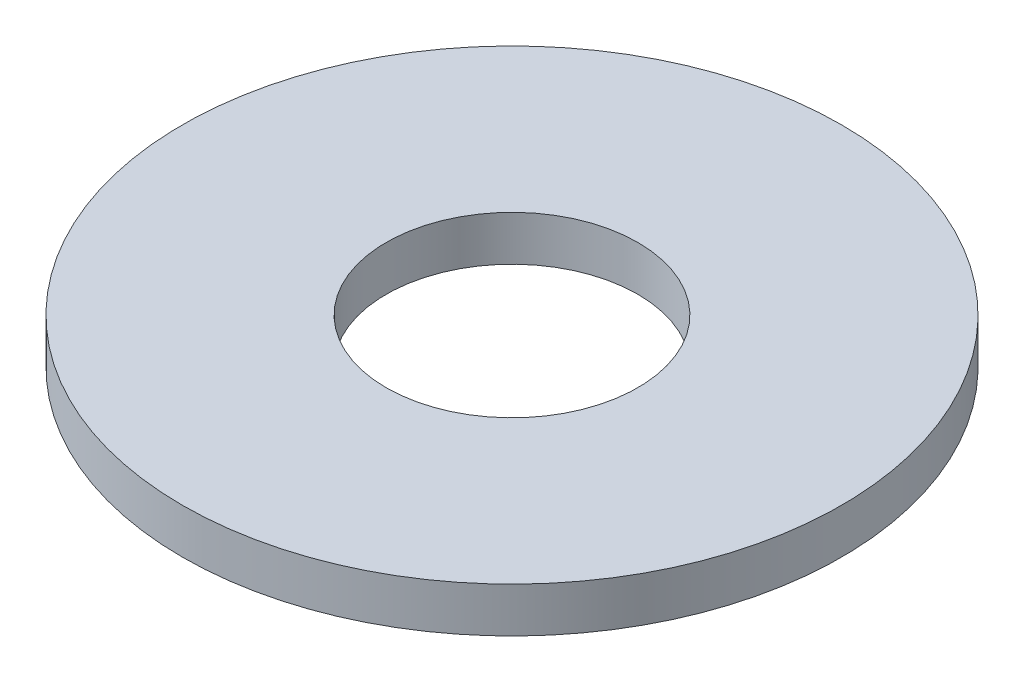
ISO-10303-21;
HEADER;
FILE_DESCRIPTION(('STEP AP214'),'2;1');
FILE_NAME('part.step','',(''),(''),'','','');
FILE_SCHEMA(('AUTOMOTIVE_DESIGN { 1 0 10303 214 1 1 1 1 }'));
ENDSEC;
DATA;
#1=APPLICATION_CONTEXT('core data for automotive mechanical design processes');
#2=APPLICATION_PROTOCOL_DEFINITION('international standard','automotive_design',2000,#1);
#3=PRODUCT_CONTEXT('',#1,'mechanical');
#4=PRODUCT('Part','Part','',(#3));
#5=PRODUCT_RELATED_PRODUCT_CATEGORY('part','',(#4));
#6=PRODUCT_DEFINITION_FORMATION('','',#4);
#7=PRODUCT_DEFINITION_CONTEXT('part definition',#1,'design');
#8=PRODUCT_DEFINITION('design','',#6,#7);
#9=PRODUCT_DEFINITION_SHAPE('','',#8);
#10=(LENGTH_UNIT() NAMED_UNIT(*) SI_UNIT(.MILLI.,.METRE.));
#11=(NAMED_UNIT(*) PLANE_ANGLE_UNIT() SI_UNIT($,.RADIAN.));
#12=(NAMED_UNIT(*) SI_UNIT($,.STERADIAN.) SOLID_ANGLE_UNIT());
#13=UNCERTAINTY_MEASURE_WITH_UNIT(LENGTH_MEASURE(1.E-05),#10,'distance_accuracy_value','');
#14=(GEOMETRIC_REPRESENTATION_CONTEXT(3) GLOBAL_UNCERTAINTY_ASSIGNED_CONTEXT((#13)) GLOBAL_UNIT_ASSIGNED_CONTEXT((#10,
#11,#12)) REPRESENTATION_CONTEXT('',''));
#15=CARTESIAN_POINT('',(0.,0.,0.));
#16=DIRECTION('',(0.,0.,1.));
#17=DIRECTION('',(1.,0.,0.));
#18=AXIS2_PLACEMENT_3D('',#15,#16,#17);
#19=CARTESIAN_POINT('',(0.,1.5,0.));
#20=DIRECTION('',(0.,1.,0.));
#21=DIRECTION('',(0.,0.,1.));
#22=AXIS2_PLACEMENT_3D('',#19,#20,#21);
#23=PLANE('',#22);
#24=CARTESIAN_POINT('',(0.,1.5,0.));
#25=DIRECTION('',(0.,1.,0.));
#26=DIRECTION('',(0.,0.,1.));
#27=AXIS2_PLACEMENT_3D('',#24,#25,#26);
#28=CIRCLE('',#27,11.);
#29=CARTESIAN_POINT('',(0.,1.5,11.));
#30=VERTEX_POINT('',#29);
#31=EDGE_CURVE('E10',#30,#30,#28,.T.);
#32=ORIENTED_EDGE('',*,*,#31,.T.);
#33=EDGE_LOOP('',(#32));
#34=FACE_BOUND('',#33,.T.);
#35=CARTESIAN_POINT('',(0.,1.5,0.));
#36=DIRECTION('',(0.,1.,0.));
#37=DIRECTION('',(0.,0.,1.));
#38=AXIS2_PLACEMENT_3D('',#35,#36,#37);
#39=CIRCLE('',#38,4.2);
#40=CARTESIAN_POINT('',(0.,1.5,4.2));
#41=VERTEX_POINT('',#40);
#42=EDGE_CURVE('E42',#41,#41,#39,.T.);
#43=ORIENTED_EDGE('',*,*,#42,.F.);
#44=EDGE_LOOP('',(#43));
#45=FACE_BOUND('',#44,.T.);
#46=ADVANCED_FACE('F31',(#34,#45),#23,.T.);
#47=CARTESIAN_POINT('',(0.,0.,0.));
#48=DIRECTION('',(0.,1.,0.));
#49=DIRECTION('',(0.,0.,1.));
#50=AXIS2_PLACEMENT_3D('',#47,#48,#49);
#51=PLANE('',#50);
#52=CARTESIAN_POINT('',(0.,0.,0.));
#53=DIRECTION('',(0.,1.,0.));
#54=DIRECTION('',(0.,0.,1.));
#55=AXIS2_PLACEMENT_3D('',#52,#53,#54);
#56=CIRCLE('',#55,11.);
#57=CARTESIAN_POINT('',(0.,0.,11.));
#58=VERTEX_POINT('',#57);
#59=EDGE_CURVE('E38',#58,#58,#56,.T.);
#60=ORIENTED_EDGE('',*,*,#59,.F.);
#61=EDGE_LOOP('',(#60));
#62=FACE_BOUND('',#61,.T.);
#63=CARTESIAN_POINT('',(0.,0.,0.));
#64=DIRECTION('',(0.,1.,0.));
#65=DIRECTION('',(0.,0.,1.));
#66=AXIS2_PLACEMENT_3D('',#63,#64,#65);
#67=CIRCLE('',#66,4.2);
#68=CARTESIAN_POINT('',(0.,0.,4.2));
#69=VERTEX_POINT('',#68);
#70=EDGE_CURVE('E46',#69,#69,#67,.T.);
#71=ORIENTED_EDGE('',*,*,#70,.T.);
#72=EDGE_LOOP('',(#71));
#73=FACE_BOUND('',#72,.T.);
#74=ADVANCED_FACE('F52',(#62,#73),#51,.F.);
#75=CARTESIAN_POINT('',(0.,1.5,0.));
#76=DIRECTION('',(0.,-1.,0.));
#77=DIRECTION('',(0.,0.,-1.));
#78=AXIS2_PLACEMENT_3D('',#75,#76,#77);
#79=CYLINDRICAL_SURFACE('',#78,11.);
#80=ORIENTED_EDGE('',*,*,#31,.F.);
#81=EDGE_LOOP('',(#80));
#82=FACE_BOUND('',#81,.T.);
#83=ORIENTED_EDGE('',*,*,#59,.T.);
#84=EDGE_LOOP('',(#83));
#85=FACE_BOUND('',#84,.T.);
#86=ADVANCED_FACE('F33',(#82,#85),#79,.T.);
#87=CARTESIAN_POINT('',(0.,1.5,0.));
#88=DIRECTION('',(0.,-1.,0.));
#89=DIRECTION('',(0.,0.,-1.));
#90=AXIS2_PLACEMENT_3D('',#87,#88,#89);
#91=CYLINDRICAL_SURFACE('',#90,4.2);
#92=ORIENTED_EDGE('',*,*,#42,.T.);
#93=EDGE_LOOP('',(#92));
#94=FACE_BOUND('',#93,.T.);
#95=ORIENTED_EDGE('',*,*,#70,.F.);
#96=EDGE_LOOP('',(#95));
#97=FACE_BOUND('',#96,.T.);
#98=ADVANCED_FACE('F54',(#94,#97),#91,.F.);
#99=CLOSED_SHELL('',(#46,#74,#86,#98));
#100=MANIFOLD_SOLID_BREP('B2',#99);
#101=ADVANCED_BREP_SHAPE_REPRESENTATION('',(#18,#100),#14);
#102=SHAPE_DEFINITION_REPRESENTATION(#9,#101);
ENDSEC;
END-ISO-10303-21;
